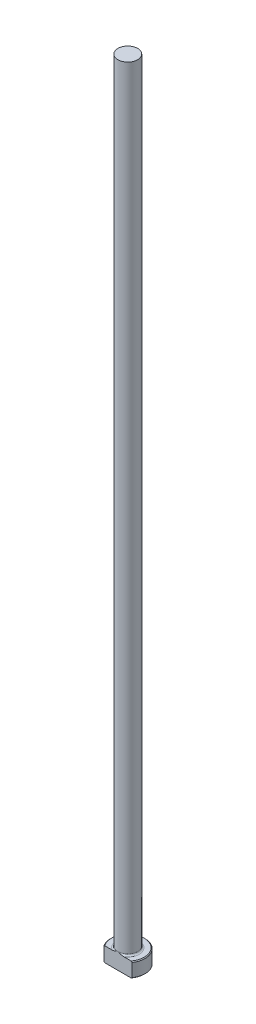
from build123d import *

# Parameters (mm, degrees)
CHAMFER1_SIZE = 0.254
FILLET1_R     = 0.508
KEY_DEPTH     = 255.121236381


with BuildPart() as part:
    # Sketch1 → Revolve1 (revolve)
    with BuildSketch(Plane.XY, mode=Mode.PRIVATE) as revolve1_sk:
        Polygon((0, 0), (-5.5499, 0), (-5.5499, 4.7498), (-3.175, 4.7498), (-3.175, 254), (0, 254), align=None)
    revolve(revolve1_sk.sketch.rotate(Axis((0, 259.958771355, 0), (0, -1, 0)), 270), axis=Axis((0, 259.958771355, 0), (0, -1, 0)))

    # Chamfer1
    chamfer1_edges = [part.edges().sort_by_distance(p)[0] for p in [
        (0, 4.7498, -5.5499),
        (0, 0, -5.5499),
    ]]
    chamfer(chamfer1_edges, length=CHAMFER1_SIZE)

    # Fillet1
    fillet1_edges = [part.edges().sort_by_distance(p)[0] for p in [
        (0, 4.7498, -3.175),
    ]]
    fillet(fillet1_edges, radius=FILLET1_R)

    # Sketch2 → KEY (cut, through all)
    with BuildSketch(Plane.XZ):
        with BuildLine():
            Line((-4.552006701, 3.175), (4.552006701, 3.175))
            ThreePointArc((4.552006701, 3.175), (0, 5.5499), (-4.552006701, 3.175))
        make_face()
    extrude(amount=-KEY_DEPTH, mode=Mode.SUBTRACT)


solid = part.part
